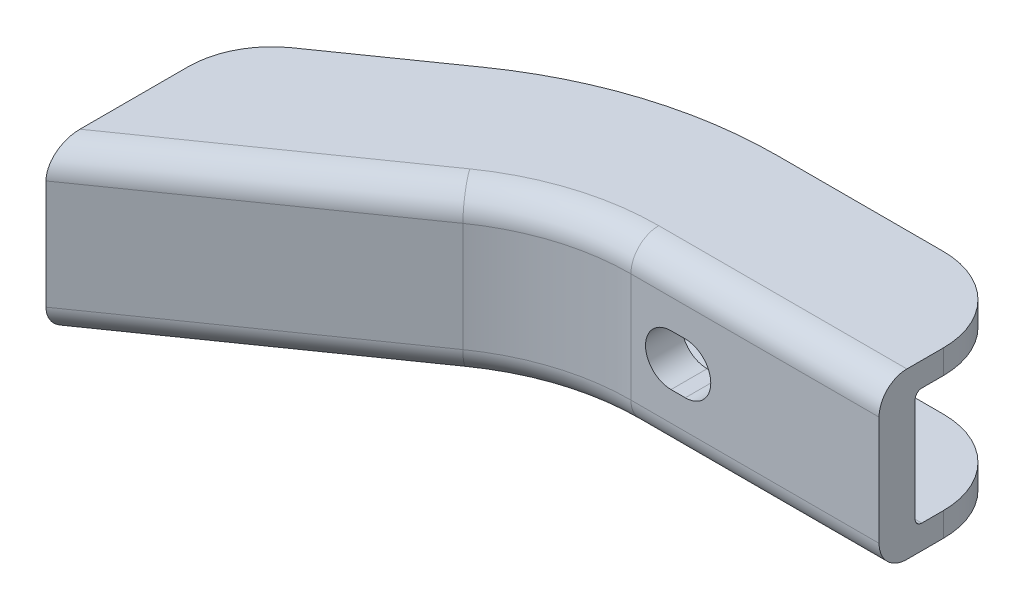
from build123d import *

# Parameters (mm, degrees)
BOSS_EXTRUDE1_DEPTH = 2.7432
BOSS_EXTRUDE2_DEPTH = 13.335
BOSS_EXTRUDE3_DEPTH = 2.7432
FILLET1_R           = 0.762
FILLET2_R           = 3.175
CUT_EXTRUDE1_DEPTH  = 12.9032


with BuildPart() as part:
    # Sketch1 → Boss-Extrude1 (new body)
    with BuildSketch(Plane(origin=(0, 0, 0), x_dir=(1, 0, 0), z_dir=(0, 1, 0))):
        with BuildLine():
            Line((0, 0), (-28.313410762, 0))
            ThreePointArc((-28.313410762, 0), (-35.95133807, -1.175589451), (-42.882252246, -4.593538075))
            Line((-42.882252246, -4.593538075), (-70.860726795, -24.184276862))
            Line((-70.860726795, -24.184276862), (-70.860726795, -7.964436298))
            ThreePointArc((-70.860726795, -7.964436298), (-69.784504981, -3.566280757), (-66.799042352, -0.162013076))
            Line((-66.799042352, -0.162013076), (-53.961532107, 8.826908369))
            ThreePointArc((-53.961532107, 8.826908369), (-41.8324323, 14.808318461), (-28.466059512, 16.8656))
            Line((-28.466059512, 16.8656), (-9.525, 16.8656))
            ThreePointArc((-9.525, 16.8656), (-2.789807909, 14.075792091), (0, 7.3406))
            Line((0, 7.3406), (0, 0))
        make_face()
    extrude(amount=BOSS_EXTRUDE1_DEPTH)

    # Sketch2 → Boss-Extrude2 (add)
    with BuildSketch(Plane(origin=(0, 2.7432, 0), x_dir=(1, 0, 0), z_dir=(0, 1, 0))):
        with BuildLine():
            Line((0, 0), (0, 4.1148))
            Line((0, 4.1148), (-28.313410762, 4.1148))
            ThreePointArc((-28.313410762, 4.1148), (-37.188682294, 2.748765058), (-45.242404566, -1.222891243))
            Line((-45.242404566, -1.222891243), (-70.860726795, -19.161033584))
            Line((-70.860726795, -19.161033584), (-70.860726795, -24.184276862))
            Line((-70.860726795, -24.184276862), (-42.882252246, -4.593538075))
            ThreePointArc((-42.882252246, -4.593538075), (-35.95133807, -1.175589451), (-28.313410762, 0))
            Line((-28.313410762, 0), (0, 0))
        make_face()
    extrude(amount=BOSS_EXTRUDE2_DEPTH)

    # Sketch3 → Boss-Extrude3 (add)
    with BuildSketch(Plane(origin=(0, 16.0782, 0), x_dir=(1, 0, 0), z_dir=(0, 1, 0))):
        with BuildLine():
            Line((-70.860726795, -7.964436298), (-70.860726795, -24.184276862))
            Line((-70.860726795, -24.184276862), (-42.882252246, -4.593538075))
            ThreePointArc((-42.882252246, -4.593538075), (-35.95133807, -1.175589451), (-28.313410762, 0))
            Line((-28.313410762, 0), (0, 0))
            Line((0, 0), (0, 7.3406))
            ThreePointArc((0, 7.3406), (-2.789807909, 14.075792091), (-9.525, 16.8656))
            Line((-9.525, 16.8656), (-28.466059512, 16.8656))
            ThreePointArc((-28.466059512, 16.8656), (-41.8324323, 14.808318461), (-53.961532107, 8.826908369))
            Line((-53.961532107, 8.826908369), (-66.799042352, -0.162013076))
            ThreePointArc((-66.799042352, -0.162013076), (-69.784504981, -3.566280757), (-70.860726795, -7.964436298))
        make_face()
    extrude(amount=BOSS_EXTRUDE3_DEPTH)

    # Fillet1
    fillet1_edges = [part.edges().sort_by_distance(p)[0] for p in [
        (-14.156705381, 2.7432, -4.1148),
        (-37.188682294, 2.7432, -2.748765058),
        (-58.051565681, 2.7432, 10.191962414),
        (-14.156705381, 16.0782, -4.1148),
        (-37.188682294, 16.0782, -2.748765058),
        (-58.051565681, 16.0782, 10.191962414),
    ]]
    fillet(fillet1_edges, radius=FILLET1_R)

    # Fillet2
    fillet2_edges = [part.edges().sort_by_distance(p)[0] for p in [
        (-56.871489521, 0, 14.388907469),
        (-56.871489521, 18.8214, 14.388907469),
        (-35.95133807, 18.8214, 1.175589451),
        (-14.156705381, 18.8214, 0),
        (-14.156705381, 0, 0),
        (-35.95133807, 0, 1.175589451),
    ]]
    fillet(fillet2_edges, radius=FILLET2_R)

    # Sketch4 → Cut-Extrude1 (cut)
    with BuildSketch(Plane(origin=(0, 0, -4.1148), x_dir=(-1, 0, 0), z_dir=(0, 0, -1))):
        with BuildLine():
            Line((22.1107, 12.319), (23.7363, 12.319))
            ThreePointArc((23.7363, 12.319), (26.6446, 9.4107), (23.7363, 6.5024))
            Line((23.7363, 6.5024), (22.1107, 6.5024))
            ThreePointArc((22.1107, 6.5024), (19.2024, 9.4107), (22.1107, 12.319))
        make_face()
    extrude(amount=-CUT_EXTRUDE1_DEPTH, mode=Mode.SUBTRACT)


solid = part.part
